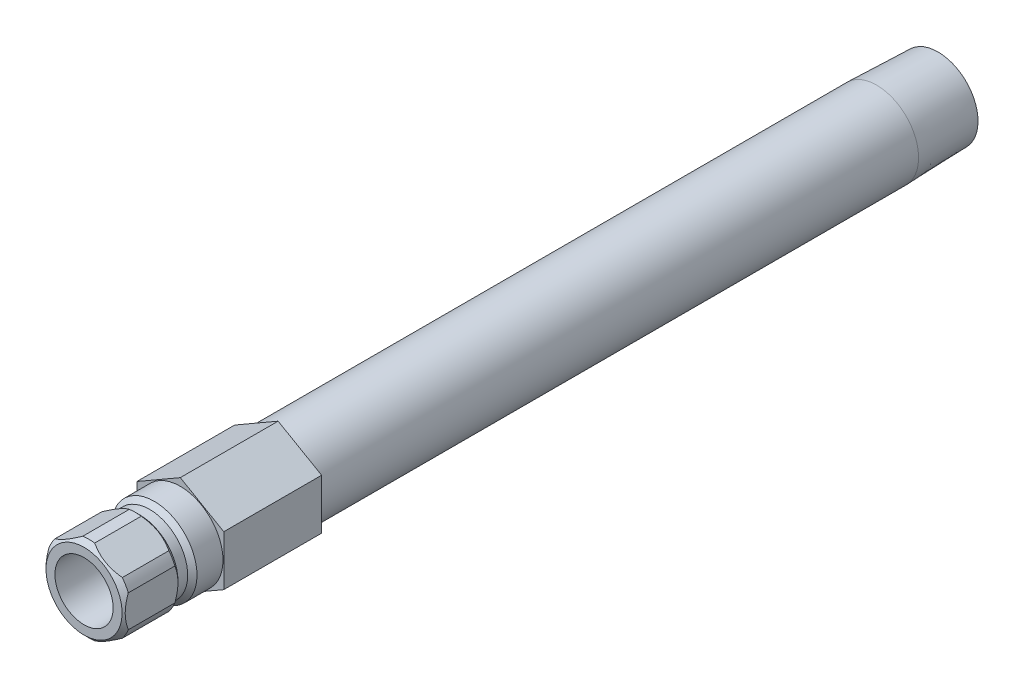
from build123d import *

# Parameters (mm, degrees)
SKETCH2_R           = 4.6228
BOSS_EXTRUDE1_DEPTH = 16.002
CUT_EXTRUDE1_START  = 6.604
SKETCH3_OUTSIDE_W   = 44.5
SKETCH3_OUTSIDE_H   = 46.7
CUT_EXTRUDE1_DEPTH  = 118.823165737


with BuildPart() as part:
    # Sketch1 → Revolve1 (revolve)
    with BuildSketch(Plane(origin=(0, 0, 0), x_dir=(0, 0, -1), z_dir=(1, 0, 0))):
        Polygon((-15.748, 4.7625), (-15.748, 6.223), (-14.986, 6.985), (-7.366, 6.985), (-6.604, 6.223), (-5.0165, 6.223), (-4.2545, 6.985), (0, 6.985), (0, 6.858), (113.919, 6.858), (123.952, 6.544470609), (123.952, 4.6228), (-3.481720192, 4.6228), (-3.556, 4.7625), align=None)
    revolve(axis=Axis((0, 0, 12.87483316), (0, 0, 1)))

    # Sketch2 → Boss-Extrude1 (add)
    with BuildSketch(Plane.XY):
        Polygon((-7.112, 4.106115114), (-7.112, -4.106115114), (0, -8.212230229), (7.112, -4.106115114), (7.112, 4.106115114), (0, 8.212230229), align=None)
        with Locations(Location((0, 0, 0), (0, 0, 90))):
            Circle(SKETCH2_R, mode=Mode.SUBTRACT)
    extrude(amount=-BOSS_EXTRUDE1_DEPTH)

    # Sketch3 outside → Cut-Extrude1 (cut, through all)
    with BuildSketch(Plane.XY.offset(CUT_EXTRUDE1_START)):
        Rectangle(SKETCH3_OUTSIDE_W, SKETCH3_OUTSIDE_H)
        Polygon((6.477, -3.739497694), (6.477, 3.739497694), (0, 7.478995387), (-6.477, 3.739497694), (-6.477, -3.739497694), (0, -7.478995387), align=None, mode=Mode.SUBTRACT)
    extrude(amount=CUT_EXTRUDE1_DEPTH, mode=Mode.SUBTRACT)


solid = part.part
